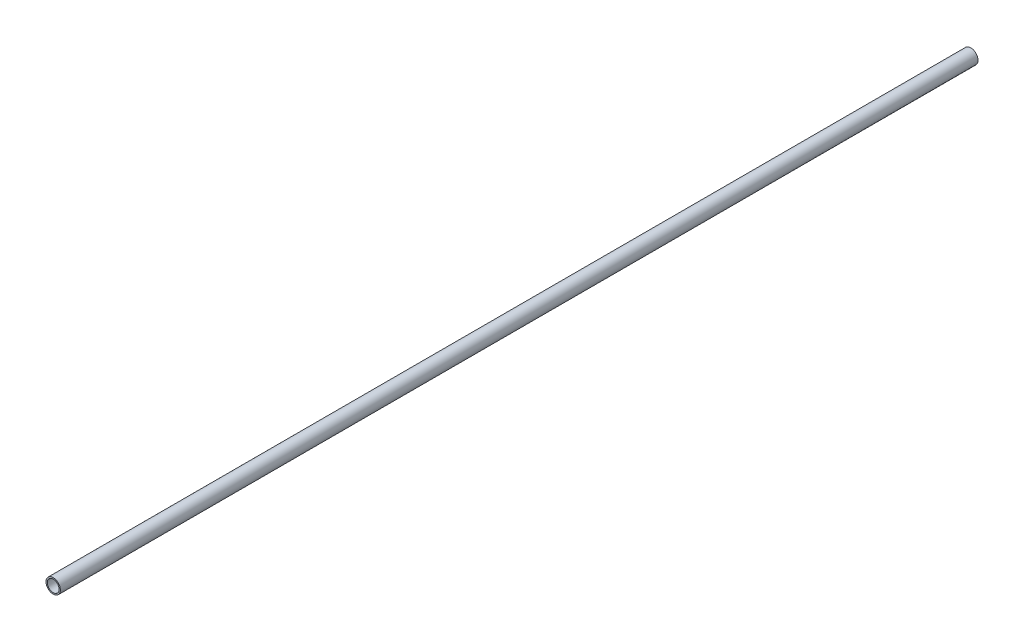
ISO-10303-21;
HEADER;
FILE_DESCRIPTION(('STEP AP214'),'2;1');
FILE_NAME('part.step','',(''),(''),'','','');
FILE_SCHEMA(('AUTOMOTIVE_DESIGN { 1 0 10303 214 1 1 1 1 }'));
ENDSEC;
DATA;
#1=APPLICATION_CONTEXT('core data for automotive mechanical design processes');
#2=APPLICATION_PROTOCOL_DEFINITION('international standard','automotive_design',2000,#1);
#3=PRODUCT_CONTEXT('',#1,'mechanical');
#4=PRODUCT('Part','Part','',(#3));
#5=PRODUCT_RELATED_PRODUCT_CATEGORY('part','',(#4));
#6=PRODUCT_DEFINITION_FORMATION('','',#4);
#7=PRODUCT_DEFINITION_CONTEXT('part definition',#1,'design');
#8=PRODUCT_DEFINITION('design','',#6,#7);
#9=PRODUCT_DEFINITION_SHAPE('','',#8);
#10=(LENGTH_UNIT() NAMED_UNIT(*) SI_UNIT(.MILLI.,.METRE.));
#11=(NAMED_UNIT(*) PLANE_ANGLE_UNIT() SI_UNIT($,.RADIAN.));
#12=(NAMED_UNIT(*) SI_UNIT($,.STERADIAN.) SOLID_ANGLE_UNIT());
#13=UNCERTAINTY_MEASURE_WITH_UNIT(LENGTH_MEASURE(1.E-05),#10,'distance_accuracy_value','');
#14=(GEOMETRIC_REPRESENTATION_CONTEXT(3) GLOBAL_UNCERTAINTY_ASSIGNED_CONTEXT((#13)) GLOBAL_UNIT_ASSIGNED_CONTEXT((#10,
#11,#12)) REPRESENTATION_CONTEXT('',''));
#15=CARTESIAN_POINT('',(0.,0.,0.));
#16=DIRECTION('',(0.,0.,1.));
#17=DIRECTION('',(1.,0.,0.));
#18=AXIS2_PLACEMENT_3D('',#15,#16,#17);
#19=CARTESIAN_POINT('',(0.,0.,280.));
#20=DIRECTION('',(0.,0.,1.));
#21=DIRECTION('',(1.,0.,0.));
#22=AXIS2_PLACEMENT_3D('',#19,#20,#21);
#23=PLANE('',#22);
#24=CARTESIAN_POINT('',(0.,0.,280.));
#25=DIRECTION('',(0.,0.,1.));
#26=DIRECTION('',(1.,0.,0.));
#27=AXIS2_PLACEMENT_3D('',#24,#25,#26);
#28=CIRCLE('',#27,2.2);
#29=CARTESIAN_POINT('',(2.2,0.,280.));
#30=VERTEX_POINT('',#29);
#31=EDGE_CURVE('E10',#30,#30,#28,.T.);
#32=ORIENTED_EDGE('',*,*,#31,.T.);
#33=EDGE_LOOP('',(#32));
#34=FACE_BOUND('',#33,.T.);
#35=CARTESIAN_POINT('',(0.,0.,280.));
#36=DIRECTION('',(0.,0.,1.));
#37=DIRECTION('',(1.,0.,0.));
#38=AXIS2_PLACEMENT_3D('',#35,#36,#37);
#39=CIRCLE('',#38,1.8);
#40=CARTESIAN_POINT('',(1.8,0.,280.));
#41=VERTEX_POINT('',#40);
#42=EDGE_CURVE('E44',#41,#41,#39,.T.);
#43=ORIENTED_EDGE('',*,*,#42,.F.);
#44=EDGE_LOOP('',(#43));
#45=FACE_BOUND('',#44,.T.);
#46=ADVANCED_FACE('F33',(#34,#45),#23,.T.);
#47=CARTESIAN_POINT('',(0.,0.,0.));
#48=DIRECTION('',(0.,0.,1.));
#49=DIRECTION('',(1.,0.,0.));
#50=AXIS2_PLACEMENT_3D('',#47,#48,#49);
#51=PLANE('',#50);
#52=CARTESIAN_POINT('',(0.,0.,0.));
#53=DIRECTION('',(0.,0.,1.));
#54=DIRECTION('',(1.,0.,0.));
#55=AXIS2_PLACEMENT_3D('',#52,#53,#54);
#56=CIRCLE('',#55,2.2);
#57=CARTESIAN_POINT('',(2.2,0.,0.));
#58=VERTEX_POINT('',#57);
#59=EDGE_CURVE('E37',#58,#58,#56,.T.);
#60=ORIENTED_EDGE('',*,*,#59,.F.);
#61=EDGE_LOOP('',(#60));
#62=FACE_BOUND('',#61,.T.);
#63=CARTESIAN_POINT('',(0.,0.,0.));
#64=DIRECTION('',(0.,0.,1.));
#65=DIRECTION('',(1.,0.,0.));
#66=AXIS2_PLACEMENT_3D('',#63,#64,#65);
#67=CIRCLE('',#66,1.8);
#68=CARTESIAN_POINT('',(1.8,0.,0.));
#69=VERTEX_POINT('',#68);
#70=EDGE_CURVE('E46',#69,#69,#67,.T.);
#71=ORIENTED_EDGE('',*,*,#70,.T.);
#72=EDGE_LOOP('',(#71));
#73=FACE_BOUND('',#72,.T.);
#74=ADVANCED_FACE('F56',(#62,#73),#51,.F.);
#75=CARTESIAN_POINT('',(0.,0.,280.));
#76=DIRECTION('',(0.,0.,-1.));
#77=DIRECTION('',(-1.,0.,0.));
#78=AXIS2_PLACEMENT_3D('',#75,#76,#77);
#79=CYLINDRICAL_SURFACE('',#78,2.2);
#80=ORIENTED_EDGE('',*,*,#31,.F.);
#81=EDGE_LOOP('',(#80));
#82=FACE_BOUND('',#81,.T.);
#83=ORIENTED_EDGE('',*,*,#59,.T.);
#84=EDGE_LOOP('',(#83));
#85=FACE_BOUND('',#84,.T.);
#86=ADVANCED_FACE('F35',(#82,#85),#79,.T.);
#87=CARTESIAN_POINT('',(0.,0.,280.));
#88=DIRECTION('',(0.,0.,-1.));
#89=DIRECTION('',(-1.,0.,0.));
#90=AXIS2_PLACEMENT_3D('',#87,#88,#89);
#91=CYLINDRICAL_SURFACE('',#90,1.8);
#92=ORIENTED_EDGE('',*,*,#42,.T.);
#93=EDGE_LOOP('',(#92));
#94=FACE_BOUND('',#93,.T.);
#95=ORIENTED_EDGE('',*,*,#70,.F.);
#96=EDGE_LOOP('',(#95));
#97=FACE_BOUND('',#96,.T.);
#98=ADVANCED_FACE('F52',(#94,#97),#91,.F.);
#99=CLOSED_SHELL('',(#46,#74,#86,#98));
#100=MANIFOLD_SOLID_BREP('B2',#99);
#101=ADVANCED_BREP_SHAPE_REPRESENTATION('',(#18,#100),#14);
#102=SHAPE_DEFINITION_REPRESENTATION(#9,#101);
ENDSEC;
END-ISO-10303-21;
